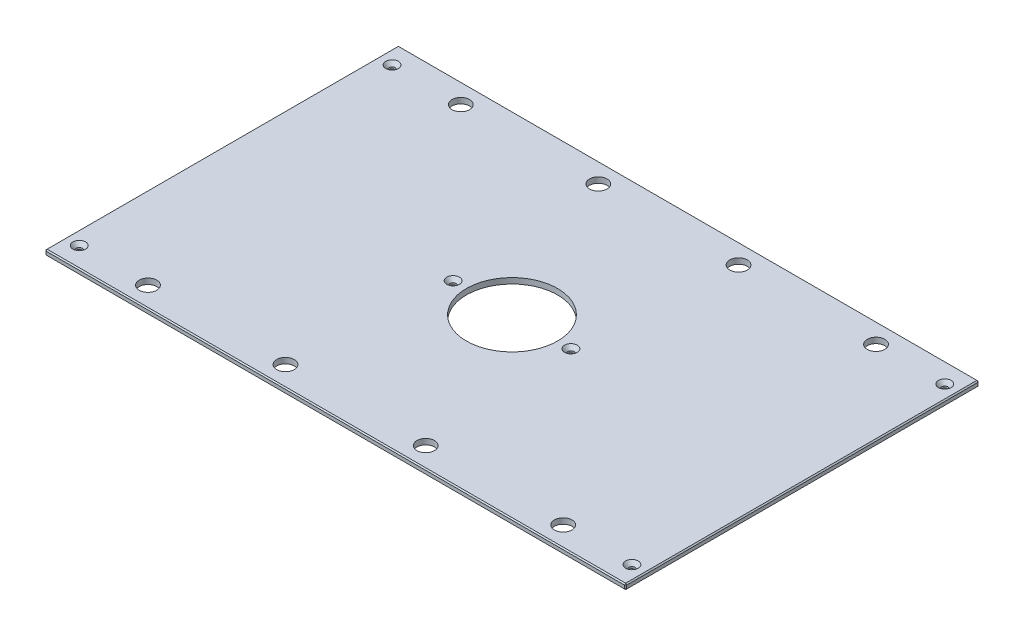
ISO-10303-21;
HEADER;
FILE_DESCRIPTION(('STEP AP214'),'2;1');
FILE_NAME('part.step','',(''),(''),'','','');
FILE_SCHEMA(('AUTOMOTIVE_DESIGN { 1 0 10303 214 1 1 1 1 }'));
ENDSEC;
DATA;
#1=APPLICATION_CONTEXT('core data for automotive mechanical design processes');
#2=APPLICATION_PROTOCOL_DEFINITION('international standard','automotive_design',2000,#1);
#3=PRODUCT_CONTEXT('',#1,'mechanical');
#4=PRODUCT('Part','Part','',(#3));
#5=PRODUCT_RELATED_PRODUCT_CATEGORY('part','',(#4));
#6=PRODUCT_DEFINITION_FORMATION('','',#4);
#7=PRODUCT_DEFINITION_CONTEXT('part definition',#1,'design');
#8=PRODUCT_DEFINITION('design','',#6,#7);
#9=PRODUCT_DEFINITION_SHAPE('','',#8);
#10=(LENGTH_UNIT() NAMED_UNIT(*) SI_UNIT(.MILLI.,.METRE.));
#11=(NAMED_UNIT(*) PLANE_ANGLE_UNIT() SI_UNIT($,.RADIAN.));
#12=(NAMED_UNIT(*) SI_UNIT($,.STERADIAN.) SOLID_ANGLE_UNIT());
#13=UNCERTAINTY_MEASURE_WITH_UNIT(LENGTH_MEASURE(1.E-05),#10,'distance_accuracy_value','');
#14=(GEOMETRIC_REPRESENTATION_CONTEXT(3) GLOBAL_UNCERTAINTY_ASSIGNED_CONTEXT((#13)) GLOBAL_UNIT_ASSIGNED_CONTEXT((#10,
#11,#12)) REPRESENTATION_CONTEXT('',''));
#15=CARTESIAN_POINT('',(0.,0.,0.));
#16=DIRECTION('',(0.,0.,1.));
#17=DIRECTION('',(1.,0.,0.));
#18=AXIS2_PLACEMENT_3D('',#15,#16,#17);
#19=CARTESIAN_POINT('',(-328.6125,6.35,-200.025));
#20=DIRECTION('',(1.,0.,0.));
#21=DIRECTION('',(0.,0.,-1.));
#22=AXIS2_PLACEMENT_3D('',#19,#20,#21);
#23=PLANE('',#22);
#24=DIRECTION('',(0.,0.,-1.));
#25=VECTOR('',#24,1.);
#26=CARTESIAN_POINT('',(-328.6125,5.08000000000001,-200.025));
#27=LINE('',#26,#25);
#28=CARTESIAN_POINT('',(-328.6125,5.08000000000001,198.755));
#29=VERTEX_POINT('',#28);
#30=CARTESIAN_POINT('',(-328.6125,5.08000000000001,-198.755));
#31=VERTEX_POINT('',#30);
#32=EDGE_CURVE('E135',#29,#31,#27,.T.);
#33=ORIENTED_EDGE('',*,*,#32,.T.);
#34=DIRECTION('',(0.,-1.,0.));
#35=VECTOR('',#34,1.);
#36=CARTESIAN_POINT('',(-328.6125,6.35,-198.755));
#37=LINE('',#36,#35);
#38=CARTESIAN_POINT('',(-328.6125,1.26999999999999,-198.755));
#39=VERTEX_POINT('',#38);
#40=EDGE_CURVE('E131',#31,#39,#37,.T.);
#41=ORIENTED_EDGE('',*,*,#40,.T.);
#42=DIRECTION('',(0.,0.,1.));
#43=VECTOR('',#42,1.);
#44=CARTESIAN_POINT('',(-328.6125,1.26999999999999,-200.025));
#45=LINE('',#44,#43);
#46=CARTESIAN_POINT('',(-328.6125,1.26999999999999,198.755));
#47=VERTEX_POINT('',#46);
#48=EDGE_CURVE('E126',#39,#47,#45,.T.);
#49=ORIENTED_EDGE('',*,*,#48,.T.);
#50=DIRECTION('',(0.,1.,0.));
#51=VECTOR('',#50,1.);
#52=CARTESIAN_POINT('',(-328.6125,6.35,198.755));
#53=LINE('',#52,#51);
#54=EDGE_CURVE('E128',#47,#29,#53,.T.);
#55=ORIENTED_EDGE('',*,*,#54,.T.);
#56=EDGE_LOOP('',(#33,#41,#49,#55));
#57=FACE_BOUND('',#56,.T.);
#58=ADVANCED_FACE('F35',(#57),#23,.F.);
#59=CARTESIAN_POINT('',(-328.6125,6.35,200.025));
#60=DIRECTION('',(0.,0.,-1.));
#61=DIRECTION('',(-1.,0.,0.));
#62=AXIS2_PLACEMENT_3D('',#59,#60,#61);
#63=PLANE('',#62);
#64=DIRECTION('',(1.,0.,0.));
#65=VECTOR('',#64,1.);
#66=CARTESIAN_POINT('',(-328.6125,1.26999999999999,200.025));
#67=LINE('',#66,#65);
#68=CARTESIAN_POINT('',(-327.3425,1.26999999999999,200.025));
#69=VERTEX_POINT('',#68);
#70=CARTESIAN_POINT('',(327.3425,1.26999999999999,200.025));
#71=VERTEX_POINT('',#70);
#72=EDGE_CURVE('E58',#69,#71,#67,.T.);
#73=ORIENTED_EDGE('',*,*,#72,.T.);
#74=DIRECTION('',(0.,1.,0.));
#75=VECTOR('',#74,1.);
#76=CARTESIAN_POINT('',(327.3425,6.35,200.025));
#77=LINE('',#76,#75);
#78=CARTESIAN_POINT('',(327.3425,5.08000000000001,200.025));
#79=VERTEX_POINT('',#78);
#80=EDGE_CURVE('E11',#71,#79,#77,.T.);
#81=ORIENTED_EDGE('',*,*,#80,.T.);
#82=DIRECTION('',(-1.,0.,0.));
#83=VECTOR('',#82,1.);
#84=CARTESIAN_POINT('',(-328.6125,5.08000000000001,200.025));
#85=LINE('',#84,#83);
#86=CARTESIAN_POINT('',(-327.3425,5.08000000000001,200.025));
#87=VERTEX_POINT('',#86);
#88=EDGE_CURVE('E44',#79,#87,#85,.T.);
#89=ORIENTED_EDGE('',*,*,#88,.T.);
#90=DIRECTION('',(0.,-1.,0.));
#91=VECTOR('',#90,1.);
#92=CARTESIAN_POINT('',(-327.3425,6.35,200.025));
#93=LINE('',#92,#91);
#94=EDGE_CURVE('E303',#87,#69,#93,.T.);
#95=ORIENTED_EDGE('',*,*,#94,.T.);
#96=EDGE_LOOP('',(#73,#81,#89,#95));
#97=FACE_BOUND('',#96,.T.);
#98=ADVANCED_FACE('F372',(#97),#63,.F.);
#99=CARTESIAN_POINT('',(328.6125,6.35,-200.025));
#100=DIRECTION('',(-1.,0.,0.));
#101=DIRECTION('',(0.,0.,1.));
#102=AXIS2_PLACEMENT_3D('',#99,#100,#101);
#103=PLANE('',#102);
#104=DIRECTION('',(0.,0.,-1.));
#105=VECTOR('',#104,1.);
#106=CARTESIAN_POINT('',(328.6125,1.26999999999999,-200.025));
#107=LINE('',#106,#105);
#108=CARTESIAN_POINT('',(328.6125,1.26999999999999,198.755));
#109=VERTEX_POINT('',#108);
#110=CARTESIAN_POINT('',(328.6125,1.26999999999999,-198.755));
#111=VERTEX_POINT('',#110);
#112=EDGE_CURVE('E298',#109,#111,#107,.T.);
#113=ORIENTED_EDGE('',*,*,#112,.T.);
#114=DIRECTION('',(0.,1.,0.));
#115=VECTOR('',#114,1.);
#116=CARTESIAN_POINT('',(328.6125,6.35,-198.755));
#117=LINE('',#116,#115);
#118=CARTESIAN_POINT('',(328.6125,5.08000000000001,-198.755));
#119=VERTEX_POINT('',#118);
#120=EDGE_CURVE('E300',#111,#119,#117,.T.);
#121=ORIENTED_EDGE('',*,*,#120,.T.);
#122=DIRECTION('',(0.,0.,1.));
#123=VECTOR('',#122,1.);
#124=CARTESIAN_POINT('',(328.6125,5.08000000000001,200.025));
#125=LINE('',#124,#123);
#126=CARTESIAN_POINT('',(328.6125,5.08000000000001,198.755));
#127=VERTEX_POINT('',#126);
#128=EDGE_CURVE('E296',#119,#127,#125,.T.);
#129=ORIENTED_EDGE('',*,*,#128,.T.);
#130=DIRECTION('',(0.,-1.,0.));
#131=VECTOR('',#130,1.);
#132=CARTESIAN_POINT('',(328.6125,6.35,198.755));
#133=LINE('',#132,#131);
#134=EDGE_CURVE('E294',#127,#109,#133,.T.);
#135=ORIENTED_EDGE('',*,*,#134,.T.);
#136=EDGE_LOOP('',(#113,#121,#129,#135));
#137=FACE_BOUND('',#136,.T.);
#138=ADVANCED_FACE('F359',(#137),#103,.F.);
#139=CARTESIAN_POINT('',(-328.6125,6.35,-200.025));
#140=DIRECTION('',(0.,0.,1.));
#141=DIRECTION('',(1.,0.,0.));
#142=AXIS2_PLACEMENT_3D('',#139,#140,#141);
#143=PLANE('',#142);
#144=DIRECTION('',(-1.,0.,0.));
#145=VECTOR('',#144,1.);
#146=CARTESIAN_POINT('',(-328.6125,1.26999999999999,-200.025));
#147=LINE('',#146,#145);
#148=CARTESIAN_POINT('',(327.3425,1.26999999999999,-200.025));
#149=VERTEX_POINT('',#148);
#150=CARTESIAN_POINT('',(-327.3425,1.26999999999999,-200.025));
#151=VERTEX_POINT('',#150);
#152=EDGE_CURVE('E270',#149,#151,#147,.T.);
#153=ORIENTED_EDGE('',*,*,#152,.T.);
#154=DIRECTION('',(0.,1.,0.));
#155=VECTOR('',#154,1.);
#156=CARTESIAN_POINT('',(-327.3425,6.35,-200.025));
#157=LINE('',#156,#155);
#158=CARTESIAN_POINT('',(-327.3425,5.08000000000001,-200.025));
#159=VERTEX_POINT('',#158);
#160=EDGE_CURVE('E274',#151,#159,#157,.T.);
#161=ORIENTED_EDGE('',*,*,#160,.T.);
#162=DIRECTION('',(1.,0.,0.));
#163=VECTOR('',#162,1.);
#164=CARTESIAN_POINT('',(328.6125,5.08000000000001,-200.025));
#165=LINE('',#164,#163);
#166=CARTESIAN_POINT('',(327.3425,5.08000000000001,-200.025));
#167=VERTEX_POINT('',#166);
#168=EDGE_CURVE('E272',#159,#167,#165,.T.);
#169=ORIENTED_EDGE('',*,*,#168,.T.);
#170=DIRECTION('',(0.,-1.,0.));
#171=VECTOR('',#170,1.);
#172=CARTESIAN_POINT('',(327.3425,6.35,-200.025));
#173=LINE('',#172,#171);
#174=EDGE_CURVE('E268',#167,#149,#173,.T.);
#175=ORIENTED_EDGE('',*,*,#174,.T.);
#176=EDGE_LOOP('',(#153,#161,#169,#175));
#177=FACE_BOUND('',#176,.T.);
#178=ADVANCED_FACE('F333',(#177),#143,.F.);
#179=CARTESIAN_POINT('',(0.,6.35,0.));
#180=DIRECTION('',(0.,1.,0.));
#181=DIRECTION('',(0.,0.,1.));
#182=AXIS2_PLACEMENT_3D('',#179,#180,#181);
#183=PLANE('',#182);
#184=CARTESIAN_POINT('',(312.7375,6.35,-177.00498));
#185=DIRECTION('',(0.,1.,0.));
#186=DIRECTION('',(0.,0.,1.));
#187=AXIS2_PLACEMENT_3D('',#184,#185,#186);
#188=CIRCLE('',#187,7.13740000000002);
#189=CARTESIAN_POINT('',(312.7375,6.35,-169.86758));
#190=VERTEX_POINT('',#189);
#191=EDGE_CURVE('E816',#190,#190,#188,.T.);
#192=ORIENTED_EDGE('',*,*,#191,.F.);
#193=EDGE_LOOP('',(#192));
#194=FACE_BOUND('',#193,.T.);
#195=CARTESIAN_POINT('',(312.7375,6.35,177.00498));
#196=DIRECTION('',(0.,1.,0.));
#197=DIRECTION('',(0.,0.,1.));
#198=AXIS2_PLACEMENT_3D('',#195,#196,#197);
#199=CIRCLE('',#198,7.13740000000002);
#200=CARTESIAN_POINT('',(312.7375,6.35,184.14238));
#201=VERTEX_POINT('',#200);
#202=EDGE_CURVE('E820',#201,#201,#199,.T.);
#203=ORIENTED_EDGE('',*,*,#202,.F.);
#204=EDGE_LOOP('',(#203));
#205=FACE_BOUND('',#204,.T.);
#206=CARTESIAN_POINT('',(-312.7375,6.35,177.00498));
#207=DIRECTION('',(0.,1.,0.));
#208=DIRECTION('',(0.,0.,1.));
#209=AXIS2_PLACEMENT_3D('',#206,#207,#208);
#210=CIRCLE('',#209,7.13740000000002);
#211=CARTESIAN_POINT('',(-312.7375,6.35,184.14238));
#212=VERTEX_POINT('',#211);
#213=EDGE_CURVE('E824',#212,#212,#210,.T.);
#214=ORIENTED_EDGE('',*,*,#213,.F.);
#215=EDGE_LOOP('',(#214));
#216=FACE_BOUND('',#215,.T.);
#217=CARTESIAN_POINT('',(-66.675,6.35,0.));
#218=DIRECTION('',(0.,1.,0.));
#219=DIRECTION('',(0.,0.,1.));
#220=AXIS2_PLACEMENT_3D('',#217,#218,#219);
#221=CIRCLE('',#220,7.1374);
#222=CARTESIAN_POINT('',(-66.675,6.35,7.1374));
#223=VERTEX_POINT('',#222);
#224=EDGE_CURVE('E828',#223,#223,#221,.T.);
#225=ORIENTED_EDGE('',*,*,#224,.F.);
#226=EDGE_LOOP('',(#225));
#227=FACE_BOUND('',#226,.T.);
#228=CARTESIAN_POINT('',(66.675,6.35,0.));
#229=DIRECTION('',(0.,1.,0.));
#230=DIRECTION('',(0.,0.,1.));
#231=AXIS2_PLACEMENT_3D('',#228,#229,#230);
#232=CIRCLE('',#231,7.1374);
#233=CARTESIAN_POINT('',(66.675,6.35,7.1374));
#234=VERTEX_POINT('',#233);
#235=EDGE_CURVE('E832',#234,#234,#232,.T.);
#236=ORIENTED_EDGE('',*,*,#235,.F.);
#237=EDGE_LOOP('',(#236));
#238=FACE_BOUND('',#237,.T.);
#239=CARTESIAN_POINT('',(-312.7375,6.35,-177.00498));
#240=DIRECTION('',(0.,1.,0.));
#241=DIRECTION('',(0.,0.,1.));
#242=AXIS2_PLACEMENT_3D('',#239,#240,#241);
#243=CIRCLE('',#242,7.13740000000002);
#244=CARTESIAN_POINT('',(-312.7375,6.35,-169.86758));
#245=VERTEX_POINT('',#244);
#246=EDGE_CURVE('E835',#245,#245,#243,.T.);
#247=ORIENTED_EDGE('',*,*,#246,.F.);
#248=EDGE_LOOP('',(#247));
#249=FACE_BOUND('',#248,.T.);
#250=DIRECTION('',(0.,0.,-1.));
#251=VECTOR('',#250,1.);
#252=CARTESIAN_POINT('',(327.3425,6.35,-200.025));
#253=LINE('',#252,#251);
#254=CARTESIAN_POINT('',(327.3425,6.35,198.755));
#255=VERTEX_POINT('',#254);
#256=CARTESIAN_POINT('',(327.3425,6.35,-198.755));
#257=VERTEX_POINT('',#256);
#258=EDGE_CURVE('E281',#255,#257,#253,.T.);
#259=ORIENTED_EDGE('',*,*,#258,.T.);
#260=DIRECTION('',(-1.,0.,0.));
#261=VECTOR('',#260,1.);
#262=CARTESIAN_POINT('',(-328.6125,6.35,-198.755));
#263=LINE('',#262,#261);
#264=CARTESIAN_POINT('',(-327.3425,6.35,-198.755));
#265=VERTEX_POINT('',#264);
#266=EDGE_CURVE('E283',#257,#265,#263,.T.);
#267=ORIENTED_EDGE('',*,*,#266,.T.);
#268=DIRECTION('',(0.,0.,1.));
#269=VECTOR('',#268,1.);
#270=CARTESIAN_POINT('',(-327.3425,6.35,200.025));
#271=LINE('',#270,#269);
#272=CARTESIAN_POINT('',(-327.3425,6.35,198.755));
#273=VERTEX_POINT('',#272);
#274=EDGE_CURVE('E279',#265,#273,#271,.T.);
#275=ORIENTED_EDGE('',*,*,#274,.T.);
#276=DIRECTION('',(1.,0.,0.));
#277=VECTOR('',#276,1.);
#278=CARTESIAN_POINT('',(328.6125,6.35,198.755));
#279=LINE('',#278,#277);
#280=EDGE_CURVE('E277',#273,#255,#279,.T.);
#281=ORIENTED_EDGE('',*,*,#280,.T.);
#282=EDGE_LOOP('',(#259,#267,#275,#281));
#283=FACE_BOUND('',#282,.T.);
#284=CARTESIAN_POINT('',(234.95,6.35,-177.00498));
#285=DIRECTION('',(0.,1.,0.));
#286=DIRECTION('',(0.,0.,1.));
#287=AXIS2_PLACEMENT_3D('',#284,#285,#286);
#288=CIRCLE('',#287,9.921875);
#289=CARTESIAN_POINT('',(234.95,6.35,-167.083105));
#290=VERTEX_POINT('',#289);
#291=EDGE_CURVE('E204',#290,#290,#288,.T.);
#292=ORIENTED_EDGE('',*,*,#291,.F.);
#293=EDGE_LOOP('',(#292));
#294=FACE_BOUND('',#293,.T.);
#295=CARTESIAN_POINT('',(-234.95,6.35,-177.00498));
#296=DIRECTION('',(0.,1.,0.));
#297=DIRECTION('',(0.,0.,1.));
#298=AXIS2_PLACEMENT_3D('',#295,#296,#297);
#299=CIRCLE('',#298,9.921875);
#300=CARTESIAN_POINT('',(-234.95,6.35,-167.083105));
#301=VERTEX_POINT('',#300);
#302=EDGE_CURVE('E214',#301,#301,#299,.T.);
#303=ORIENTED_EDGE('',*,*,#302,.F.);
#304=EDGE_LOOP('',(#303));
#305=FACE_BOUND('',#304,.T.);
#306=CARTESIAN_POINT('',(234.95,6.35,177.00498));
#307=DIRECTION('',(0.,1.,0.));
#308=DIRECTION('',(0.,0.,1.));
#309=AXIS2_PLACEMENT_3D('',#306,#307,#308);
#310=CIRCLE('',#309,9.921875);
#311=CARTESIAN_POINT('',(234.95,6.35,186.926855));
#312=VERTEX_POINT('',#311);
#313=EDGE_CURVE('E225',#312,#312,#310,.T.);
#314=ORIENTED_EDGE('',*,*,#313,.F.);
#315=EDGE_LOOP('',(#314));
#316=FACE_BOUND('',#315,.T.);
#317=CARTESIAN_POINT('',(-234.95,6.35,177.00498));
#318=DIRECTION('',(0.,1.,0.));
#319=DIRECTION('',(0.,0.,1.));
#320=AXIS2_PLACEMENT_3D('',#317,#318,#319);
#321=CIRCLE('',#320,9.921875);
#322=CARTESIAN_POINT('',(-234.95,6.35,186.926855));
#323=VERTEX_POINT('',#322);
#324=EDGE_CURVE('E231',#323,#323,#321,.T.);
#325=ORIENTED_EDGE('',*,*,#324,.F.);
#326=EDGE_LOOP('',(#325));
#327=FACE_BOUND('',#326,.T.);
#328=CARTESIAN_POINT('',(-79.375,6.35,-177.00498));
#329=DIRECTION('',(0.,1.,0.));
#330=DIRECTION('',(0.,0.,1.));
#331=AXIS2_PLACEMENT_3D('',#328,#329,#330);
#332=CIRCLE('',#331,9.921875);
#333=CARTESIAN_POINT('',(-79.375,6.35,-167.083105));
#334=VERTEX_POINT('',#333);
#335=EDGE_CURVE('E237',#334,#334,#332,.T.);
#336=ORIENTED_EDGE('',*,*,#335,.F.);
#337=EDGE_LOOP('',(#336));
#338=FACE_BOUND('',#337,.T.);
#339=CARTESIAN_POINT('',(79.375,6.35,-177.00498));
#340=DIRECTION('',(0.,1.,0.));
#341=DIRECTION('',(0.,0.,1.));
#342=AXIS2_PLACEMENT_3D('',#339,#340,#341);
#343=CIRCLE('',#342,9.921875);
#344=CARTESIAN_POINT('',(79.375,6.35,-167.083105));
#345=VERTEX_POINT('',#344);
#346=EDGE_CURVE('E243',#345,#345,#343,.T.);
#347=ORIENTED_EDGE('',*,*,#346,.F.);
#348=EDGE_LOOP('',(#347));
#349=FACE_BOUND('',#348,.T.);
#350=CARTESIAN_POINT('',(79.375,6.35,177.00498));
#351=DIRECTION('',(0.,1.,0.));
#352=DIRECTION('',(0.,0.,1.));
#353=AXIS2_PLACEMENT_3D('',#350,#351,#352);
#354=CIRCLE('',#353,9.921875);
#355=CARTESIAN_POINT('',(79.375,6.35,186.926855));
#356=VERTEX_POINT('',#355);
#357=EDGE_CURVE('E249',#356,#356,#354,.T.);
#358=ORIENTED_EDGE('',*,*,#357,.F.);
#359=EDGE_LOOP('',(#358));
#360=FACE_BOUND('',#359,.T.);
#361=CARTESIAN_POINT('',(-79.375,6.35,177.00498));
#362=DIRECTION('',(0.,1.,0.));
#363=DIRECTION('',(0.,0.,1.));
#364=AXIS2_PLACEMENT_3D('',#361,#362,#363);
#365=CIRCLE('',#364,9.921875);
#366=CARTESIAN_POINT('',(-79.375,6.35,186.926855));
#367=VERTEX_POINT('',#366);
#368=EDGE_CURVE('E255',#367,#367,#365,.T.);
#369=ORIENTED_EDGE('',*,*,#368,.F.);
#370=EDGE_LOOP('',(#369));
#371=FACE_BOUND('',#370,.T.);
#372=CARTESIAN_POINT('',(0.,6.35,0.));
#373=DIRECTION('',(0.,1.,0.));
#374=DIRECTION('',(0.,0.,1.));
#375=AXIS2_PLACEMENT_3D('',#372,#373,#374);
#376=CIRCLE('',#375,51.562);
#377=CARTESIAN_POINT('',(0.,6.35,51.562));
#378=VERTEX_POINT('',#377);
#379=EDGE_CURVE('E261',#378,#378,#376,.T.);
#380=ORIENTED_EDGE('',*,*,#379,.F.);
#381=EDGE_LOOP('',(#380));
#382=FACE_BOUND('',#381,.T.);
#383=ADVANCED_FACE('F381',(#194,#205,#216,#227,#238,#249,#283,#294,#305,#316,#327,#338,#349,
#360,#371,#382),#183,.T.);
#384=CARTESIAN_POINT('',(0.,0.,0.));
#385=DIRECTION('',(0.,1.,0.));
#386=DIRECTION('',(0.,0.,1.));
#387=AXIS2_PLACEMENT_3D('',#384,#385,#386);
#388=PLANE('',#387);
#389=CARTESIAN_POINT('',(312.7375,0.,-177.00498));
#390=DIRECTION('',(0.,1.,0.));
#391=DIRECTION('',(0.,0.,1.));
#392=AXIS2_PLACEMENT_3D('',#389,#390,#391);
#393=CIRCLE('',#392,3.3782);
#394=CARTESIAN_POINT('',(312.7375,0.,-173.62678));
#395=VERTEX_POINT('',#394);
#396=EDGE_CURVE('E869',#395,#395,#393,.T.);
#397=ORIENTED_EDGE('',*,*,#396,.T.);
#398=EDGE_LOOP('',(#397));
#399=FACE_BOUND('',#398,.T.);
#400=CARTESIAN_POINT('',(312.7375,0.,177.00498));
#401=DIRECTION('',(0.,1.,0.));
#402=DIRECTION('',(0.,0.,1.));
#403=AXIS2_PLACEMENT_3D('',#400,#401,#402);
#404=CIRCLE('',#403,3.3782);
#405=CARTESIAN_POINT('',(312.7375,0.,180.38318));
#406=VERTEX_POINT('',#405);
#407=EDGE_CURVE('E862',#406,#406,#404,.T.);
#408=ORIENTED_EDGE('',*,*,#407,.T.);
#409=EDGE_LOOP('',(#408));
#410=FACE_BOUND('',#409,.T.);
#411=CARTESIAN_POINT('',(-312.7375,0.,177.00498));
#412=DIRECTION('',(0.,1.,0.));
#413=DIRECTION('',(0.,0.,1.));
#414=AXIS2_PLACEMENT_3D('',#411,#412,#413);
#415=CIRCLE('',#414,3.3782);
#416=CARTESIAN_POINT('',(-312.7375,0.,180.38318));
#417=VERTEX_POINT('',#416);
#418=EDGE_CURVE('E855',#417,#417,#415,.T.);
#419=ORIENTED_EDGE('',*,*,#418,.T.);
#420=EDGE_LOOP('',(#419));
#421=FACE_BOUND('',#420,.T.);
#422=CARTESIAN_POINT('',(-66.675,0.,0.));
#423=DIRECTION('',(0.,1.,0.));
#424=DIRECTION('',(0.,0.,1.));
#425=AXIS2_PLACEMENT_3D('',#422,#423,#424);
#426=CIRCLE('',#425,3.3782);
#427=CARTESIAN_POINT('',(-66.675,0.,3.3782));
#428=VERTEX_POINT('',#427);
#429=EDGE_CURVE('E848',#428,#428,#426,.T.);
#430=ORIENTED_EDGE('',*,*,#429,.T.);
#431=EDGE_LOOP('',(#430));
#432=FACE_BOUND('',#431,.T.);
#433=CARTESIAN_POINT('',(66.675,0.,0.));
#434=DIRECTION('',(0.,1.,0.));
#435=DIRECTION('',(0.,0.,1.));
#436=AXIS2_PLACEMENT_3D('',#433,#434,#435);
#437=CIRCLE('',#436,3.3782);
#438=CARTESIAN_POINT('',(66.675,0.,3.3782));
#439=VERTEX_POINT('',#438);
#440=EDGE_CURVE('E838',#439,#439,#437,.T.);
#441=ORIENTED_EDGE('',*,*,#440,.T.);
#442=EDGE_LOOP('',(#441));
#443=FACE_BOUND('',#442,.T.);
#444=CARTESIAN_POINT('',(-312.7375,0.,-177.00498));
#445=DIRECTION('',(0.,1.,0.));
#446=DIRECTION('',(0.,0.,1.));
#447=AXIS2_PLACEMENT_3D('',#444,#445,#446);
#448=CIRCLE('',#447,3.3782);
#449=CARTESIAN_POINT('',(-312.7375,0.,-173.62678));
#450=VERTEX_POINT('',#449);
#451=EDGE_CURVE('E217',#450,#450,#448,.T.);
#452=ORIENTED_EDGE('',*,*,#451,.T.);
#453=EDGE_LOOP('',(#452));
#454=FACE_BOUND('',#453,.T.);
#455=DIRECTION('',(0.,0.,-1.));
#456=VECTOR('',#455,1.);
#457=CARTESIAN_POINT('',(-327.3425,0.,0.));
#458=LINE('',#457,#456);
#459=CARTESIAN_POINT('',(-327.3425,0.,198.755));
#460=VERTEX_POINT('',#459);
#461=CARTESIAN_POINT('',(-327.3425,0.,-198.755));
#462=VERTEX_POINT('',#461);
#463=EDGE_CURVE('E158',#460,#462,#458,.T.);
#464=ORIENTED_EDGE('',*,*,#463,.T.);
#465=DIRECTION('',(1.,0.,0.));
#466=VECTOR('',#465,1.);
#467=CARTESIAN_POINT('',(0.,0.,-198.755));
#468=LINE('',#467,#466);
#469=CARTESIAN_POINT('',(327.3425,0.,-198.755));
#470=VERTEX_POINT('',#469);
#471=EDGE_CURVE('E291',#462,#470,#468,.T.);
#472=ORIENTED_EDGE('',*,*,#471,.T.);
#473=DIRECTION('',(0.,0.,1.));
#474=VECTOR('',#473,1.);
#475=CARTESIAN_POINT('',(327.3425,0.,0.));
#476=LINE('',#475,#474);
#477=CARTESIAN_POINT('',(327.3425,0.,198.755));
#478=VERTEX_POINT('',#477);
#479=EDGE_CURVE('E289',#470,#478,#476,.T.);
#480=ORIENTED_EDGE('',*,*,#479,.T.);
#481=DIRECTION('',(-1.,0.,0.));
#482=VECTOR('',#481,1.);
#483=CARTESIAN_POINT('',(0.,0.,198.755));
#484=LINE('',#483,#482);
#485=EDGE_CURVE('E286',#478,#460,#484,.T.);
#486=ORIENTED_EDGE('',*,*,#485,.T.);
#487=EDGE_LOOP('',(#464,#472,#480,#486));
#488=FACE_BOUND('',#487,.T.);
#489=CARTESIAN_POINT('',(234.95,0.,-177.00498));
#490=DIRECTION('',(0.,1.,0.));
#491=DIRECTION('',(0.,0.,1.));
#492=AXIS2_PLACEMENT_3D('',#489,#490,#491);
#493=CIRCLE('',#492,9.921875);
#494=CARTESIAN_POINT('',(234.95,0.,-167.083105));
#495=VERTEX_POINT('',#494);
#496=EDGE_CURVE('E209',#495,#495,#493,.T.);
#497=ORIENTED_EDGE('',*,*,#496,.T.);
#498=EDGE_LOOP('',(#497));
#499=FACE_BOUND('',#498,.T.);
#500=CARTESIAN_POINT('',(-234.95,0.,-177.00498));
#501=DIRECTION('',(0.,1.,0.));
#502=DIRECTION('',(0.,0.,1.));
#503=AXIS2_PLACEMENT_3D('',#500,#501,#502);
#504=CIRCLE('',#503,9.921875);
#505=CARTESIAN_POINT('',(-234.95,0.,-167.083105));
#506=VERTEX_POINT('',#505);
#507=EDGE_CURVE('E222',#506,#506,#504,.T.);
#508=ORIENTED_EDGE('',*,*,#507,.T.);
#509=EDGE_LOOP('',(#508));
#510=FACE_BOUND('',#509,.T.);
#511=CARTESIAN_POINT('',(234.95,0.,177.00498));
#512=DIRECTION('',(0.,1.,0.));
#513=DIRECTION('',(0.,0.,1.));
#514=AXIS2_PLACEMENT_3D('',#511,#512,#513);
#515=CIRCLE('',#514,9.921875);
#516=CARTESIAN_POINT('',(234.95,0.,186.926855));
#517=VERTEX_POINT('',#516);
#518=EDGE_CURVE('E228',#517,#517,#515,.T.);
#519=ORIENTED_EDGE('',*,*,#518,.T.);
#520=EDGE_LOOP('',(#519));
#521=FACE_BOUND('',#520,.T.);
#522=CARTESIAN_POINT('',(-234.95,0.,177.00498));
#523=DIRECTION('',(0.,1.,0.));
#524=DIRECTION('',(0.,0.,1.));
#525=AXIS2_PLACEMENT_3D('',#522,#523,#524);
#526=CIRCLE('',#525,9.921875);
#527=CARTESIAN_POINT('',(-234.95,0.,186.926855));
#528=VERTEX_POINT('',#527);
#529=EDGE_CURVE('E234',#528,#528,#526,.T.);
#530=ORIENTED_EDGE('',*,*,#529,.T.);
#531=EDGE_LOOP('',(#530));
#532=FACE_BOUND('',#531,.T.);
#533=CARTESIAN_POINT('',(-79.375,0.,-177.00498));
#534=DIRECTION('',(0.,1.,0.));
#535=DIRECTION('',(0.,0.,1.));
#536=AXIS2_PLACEMENT_3D('',#533,#534,#535);
#537=CIRCLE('',#536,9.921875);
#538=CARTESIAN_POINT('',(-79.375,0.,-167.083105));
#539=VERTEX_POINT('',#538);
#540=EDGE_CURVE('E240',#539,#539,#537,.T.);
#541=ORIENTED_EDGE('',*,*,#540,.T.);
#542=EDGE_LOOP('',(#541));
#543=FACE_BOUND('',#542,.T.);
#544=CARTESIAN_POINT('',(79.375,0.,-177.00498));
#545=DIRECTION('',(0.,1.,0.));
#546=DIRECTION('',(0.,0.,1.));
#547=AXIS2_PLACEMENT_3D('',#544,#545,#546);
#548=CIRCLE('',#547,9.921875);
#549=CARTESIAN_POINT('',(79.375,0.,-167.083105));
#550=VERTEX_POINT('',#549);
#551=EDGE_CURVE('E246',#550,#550,#548,.T.);
#552=ORIENTED_EDGE('',*,*,#551,.T.);
#553=EDGE_LOOP('',(#552));
#554=FACE_BOUND('',#553,.T.);
#555=CARTESIAN_POINT('',(79.375,0.,177.00498));
#556=DIRECTION('',(0.,1.,0.));
#557=DIRECTION('',(0.,0.,1.));
#558=AXIS2_PLACEMENT_3D('',#555,#556,#557);
#559=CIRCLE('',#558,9.921875);
#560=CARTESIAN_POINT('',(79.375,0.,186.926855));
#561=VERTEX_POINT('',#560);
#562=EDGE_CURVE('E252',#561,#561,#559,.T.);
#563=ORIENTED_EDGE('',*,*,#562,.T.);
#564=EDGE_LOOP('',(#563));
#565=FACE_BOUND('',#564,.T.);
#566=CARTESIAN_POINT('',(-79.375,0.,177.00498));
#567=DIRECTION('',(0.,1.,0.));
#568=DIRECTION('',(0.,0.,1.));
#569=AXIS2_PLACEMENT_3D('',#566,#567,#568);
#570=CIRCLE('',#569,9.921875);
#571=CARTESIAN_POINT('',(-79.375,0.,186.926855));
#572=VERTEX_POINT('',#571);
#573=EDGE_CURVE('E258',#572,#572,#570,.T.);
#574=ORIENTED_EDGE('',*,*,#573,.T.);
#575=EDGE_LOOP('',(#574));
#576=FACE_BOUND('',#575,.T.);
#577=CARTESIAN_POINT('',(0.,0.,0.));
#578=DIRECTION('',(0.,1.,0.));
#579=DIRECTION('',(0.,0.,1.));
#580=AXIS2_PLACEMENT_3D('',#577,#578,#579);
#581=CIRCLE('',#580,51.562);
#582=CARTESIAN_POINT('',(0.,0.,51.562));
#583=VERTEX_POINT('',#582);
#584=EDGE_CURVE('E147',#583,#583,#581,.T.);
#585=ORIENTED_EDGE('',*,*,#584,.T.);
#586=EDGE_LOOP('',(#585));
#587=FACE_BOUND('',#586,.T.);
#588=ADVANCED_FACE('F346',(#399,#410,#421,#432,#443,#454,#488,#499,#510,#521,#532,#543,#554,
#565,#576,#587),#388,.F.);
#589=CARTESIAN_POINT('',(0.,0.,0.));
#590=DIRECTION('',(0.,1.,0.));
#591=DIRECTION('',(0.,0.,1.));
#592=AXIS2_PLACEMENT_3D('',#589,#590,#591);
#593=CYLINDRICAL_SURFACE('',#592,51.562);
#594=ORIENTED_EDGE('',*,*,#584,.F.);
#595=EDGE_LOOP('',(#594));
#596=FACE_BOUND('',#595,.T.);
#597=ORIENTED_EDGE('',*,*,#379,.T.);
#598=EDGE_LOOP('',(#597));
#599=FACE_BOUND('',#598,.T.);
#600=ADVANCED_FACE('F751',(#596,#599),#593,.F.);
#601=CARTESIAN_POINT('',(-79.375,6.35,177.00498));
#602=DIRECTION('',(0.,1.,0.));
#603=DIRECTION('',(0.,0.,1.));
#604=AXIS2_PLACEMENT_3D('',#601,#602,#603);
#605=CYLINDRICAL_SURFACE('',#604,9.921875);
#606=ORIENTED_EDGE('',*,*,#573,.F.);
#607=EDGE_LOOP('',(#606));
#608=FACE_BOUND('',#607,.T.);
#609=ORIENTED_EDGE('',*,*,#368,.T.);
#610=EDGE_LOOP('',(#609));
#611=FACE_BOUND('',#610,.T.);
#612=ADVANCED_FACE('F742',(#608,#611),#605,.F.);
#613=CARTESIAN_POINT('',(79.375,6.35,177.00498));
#614=DIRECTION('',(0.,1.,0.));
#615=DIRECTION('',(0.,0.,1.));
#616=AXIS2_PLACEMENT_3D('',#613,#614,#615);
#617=CYLINDRICAL_SURFACE('',#616,9.921875);
#618=ORIENTED_EDGE('',*,*,#562,.F.);
#619=EDGE_LOOP('',(#618));
#620=FACE_BOUND('',#619,.T.);
#621=ORIENTED_EDGE('',*,*,#357,.T.);
#622=EDGE_LOOP('',(#621));
#623=FACE_BOUND('',#622,.T.);
#624=ADVANCED_FACE('F733',(#620,#623),#617,.F.);
#625=CARTESIAN_POINT('',(79.375,6.35,-177.00498));
#626=DIRECTION('',(0.,1.,0.));
#627=DIRECTION('',(0.,0.,1.));
#628=AXIS2_PLACEMENT_3D('',#625,#626,#627);
#629=CYLINDRICAL_SURFACE('',#628,9.921875);
#630=ORIENTED_EDGE('',*,*,#551,.F.);
#631=EDGE_LOOP('',(#630));
#632=FACE_BOUND('',#631,.T.);
#633=ORIENTED_EDGE('',*,*,#346,.T.);
#634=EDGE_LOOP('',(#633));
#635=FACE_BOUND('',#634,.T.);
#636=ADVANCED_FACE('F724',(#632,#635),#629,.F.);
#637=CARTESIAN_POINT('',(-79.375,6.35,-177.00498));
#638=DIRECTION('',(0.,1.,0.));
#639=DIRECTION('',(0.,0.,1.));
#640=AXIS2_PLACEMENT_3D('',#637,#638,#639);
#641=CYLINDRICAL_SURFACE('',#640,9.921875);
#642=ORIENTED_EDGE('',*,*,#540,.F.);
#643=EDGE_LOOP('',(#642));
#644=FACE_BOUND('',#643,.T.);
#645=ORIENTED_EDGE('',*,*,#335,.T.);
#646=EDGE_LOOP('',(#645));
#647=FACE_BOUND('',#646,.T.);
#648=ADVANCED_FACE('F715',(#644,#647),#641,.F.);
#649=CARTESIAN_POINT('',(-234.95,6.35,177.00498));
#650=DIRECTION('',(0.,1.,0.));
#651=DIRECTION('',(0.,0.,1.));
#652=AXIS2_PLACEMENT_3D('',#649,#650,#651);
#653=CYLINDRICAL_SURFACE('',#652,9.921875);
#654=ORIENTED_EDGE('',*,*,#529,.F.);
#655=EDGE_LOOP('',(#654));
#656=FACE_BOUND('',#655,.T.);
#657=ORIENTED_EDGE('',*,*,#324,.T.);
#658=EDGE_LOOP('',(#657));
#659=FACE_BOUND('',#658,.T.);
#660=ADVANCED_FACE('F706',(#656,#659),#653,.F.);
#661=CARTESIAN_POINT('',(234.95,6.35,177.00498));
#662=DIRECTION('',(0.,1.,0.));
#663=DIRECTION('',(0.,0.,1.));
#664=AXIS2_PLACEMENT_3D('',#661,#662,#663);
#665=CYLINDRICAL_SURFACE('',#664,9.921875);
#666=ORIENTED_EDGE('',*,*,#518,.F.);
#667=EDGE_LOOP('',(#666));
#668=FACE_BOUND('',#667,.T.);
#669=ORIENTED_EDGE('',*,*,#313,.T.);
#670=EDGE_LOOP('',(#669));
#671=FACE_BOUND('',#670,.T.);
#672=ADVANCED_FACE('F697',(#668,#671),#665,.F.);
#673=CARTESIAN_POINT('',(-234.95,6.35,-177.00498));
#674=DIRECTION('',(0.,1.,0.));
#675=DIRECTION('',(0.,0.,1.));
#676=AXIS2_PLACEMENT_3D('',#673,#674,#675);
#677=CYLINDRICAL_SURFACE('',#676,9.921875);
#678=ORIENTED_EDGE('',*,*,#507,.F.);
#679=EDGE_LOOP('',(#678));
#680=FACE_BOUND('',#679,.T.);
#681=ORIENTED_EDGE('',*,*,#302,.T.);
#682=EDGE_LOOP('',(#681));
#683=FACE_BOUND('',#682,.T.);
#684=ADVANCED_FACE('F687',(#680,#683),#677,.F.);
#685=CARTESIAN_POINT('',(234.95,6.35,-177.00498));
#686=DIRECTION('',(0.,1.,0.));
#687=DIRECTION('',(0.,0.,1.));
#688=AXIS2_PLACEMENT_3D('',#685,#686,#687);
#689=CYLINDRICAL_SURFACE('',#688,9.921875);
#690=ORIENTED_EDGE('',*,*,#496,.F.);
#691=EDGE_LOOP('',(#690));
#692=FACE_BOUND('',#691,.T.);
#693=ORIENTED_EDGE('',*,*,#291,.T.);
#694=EDGE_LOOP('',(#693));
#695=FACE_BOUND('',#694,.T.);
#696=ADVANCED_FACE('F390',(#692,#695),#689,.F.);
#697=CARTESIAN_POINT('',(328.6125,6.35,198.755));
#698=DIRECTION('',(-0.707106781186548,0.,-0.707106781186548));
#699=DIRECTION('',(0.,-1.,0.));
#700=AXIS2_PLACEMENT_3D('',#697,#698,#699);
#701=PLANE('',#700);
#702=DIRECTION('',(-0.707106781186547,0.,0.707106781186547));
#703=VECTOR('',#702,1.);
#704=CARTESIAN_POINT('',(328.6125,5.08000000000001,198.755));
#705=LINE('',#704,#703);
#706=EDGE_CURVE('E39',#79,#127,#705,.F.);
#707=ORIENTED_EDGE('',*,*,#706,.F.);
#708=ORIENTED_EDGE('',*,*,#80,.F.);
#709=DIRECTION('',(0.707106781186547,0.,-0.707106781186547));
#710=VECTOR('',#709,1.);
#711=CARTESIAN_POINT('',(327.9775,1.26999999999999,199.39));
#712=LINE('',#711,#710);
#713=EDGE_CURVE('E197',#109,#71,#712,.F.);
#714=ORIENTED_EDGE('',*,*,#713,.F.);
#715=ORIENTED_EDGE('',*,*,#134,.F.);
#716=EDGE_LOOP('',(#707,#708,#714,#715));
#717=FACE_BOUND('',#716,.T.);
#718=ADVANCED_FACE('F37',(#717),#701,.F.);
#719=CARTESIAN_POINT('',(328.6125,5.08000000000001,198.755));
#720=DIRECTION('',(0.577350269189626,0.577350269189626,0.577350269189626));
#721=DIRECTION('',(0.707106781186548,0.,-0.707106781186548));
#722=AXIS2_PLACEMENT_3D('',#719,#720,#721);
#723=PLANE('',#722);
#724=DIRECTION('',(0.,-0.707106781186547,0.707106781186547));
#725=VECTOR('',#724,1.);
#726=CARTESIAN_POINT('',(327.3425,5.715,199.39));
#727=LINE('',#726,#725);
#728=EDGE_CURVE('E193',#79,#255,#727,.F.);
#729=ORIENTED_EDGE('',*,*,#728,.F.);
#730=ORIENTED_EDGE('',*,*,#706,.T.);
#731=DIRECTION('',(-0.707106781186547,0.707106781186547,0.));
#732=VECTOR('',#731,1.);
#733=CARTESIAN_POINT('',(328.6125,5.08000000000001,198.755));
#734=LINE('',#733,#732);
#735=EDGE_CURVE('E195',#255,#127,#734,.F.);
#736=ORIENTED_EDGE('',*,*,#735,.F.);
#737=EDGE_LOOP('',(#729,#730,#736));
#738=FACE_BOUND('',#737,.T.);
#739=ADVANCED_FACE('F383',(#738),#723,.T.);
#740=CARTESIAN_POINT('',(327.3425,0.,198.755));
#741=DIRECTION('',(0.577350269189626,-0.577350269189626,0.577350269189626));
#742=DIRECTION('',(0.707106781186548,0.,-0.707106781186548));
#743=AXIS2_PLACEMENT_3D('',#740,#741,#742);
#744=PLANE('',#743);
#745=DIRECTION('',(-0.707106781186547,-0.707106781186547,0.));
#746=VECTOR('',#745,1.);
#747=CARTESIAN_POINT('',(327.3425,0.,198.755));
#748=LINE('',#747,#746);
#749=EDGE_CURVE('E187',#109,#478,#748,.T.);
#750=ORIENTED_EDGE('',*,*,#749,.F.);
#751=ORIENTED_EDGE('',*,*,#713,.T.);
#752=DIRECTION('',(0.,0.707106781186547,0.707106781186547));
#753=VECTOR('',#752,1.);
#754=CARTESIAN_POINT('',(327.3425,0.,198.755));
#755=LINE('',#754,#753);
#756=EDGE_CURVE('E190',#478,#71,#755,.T.);
#757=ORIENTED_EDGE('',*,*,#756,.F.);
#758=EDGE_LOOP('',(#750,#751,#757));
#759=FACE_BOUND('',#758,.T.);
#760=ADVANCED_FACE('F352',(#759),#744,.T.);
#761=CARTESIAN_POINT('',(327.3425,6.35,0.));
#762=DIRECTION('',(0.707106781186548,0.707106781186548,0.));
#763=DIRECTION('',(0.,0.,1.));
#764=AXIS2_PLACEMENT_3D('',#761,#762,#763);
#765=PLANE('',#764);
#766=ORIENTED_EDGE('',*,*,#735,.T.);
#767=ORIENTED_EDGE('',*,*,#128,.F.);
#768=DIRECTION('',(0.707106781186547,-0.707106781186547,0.));
#769=VECTOR('',#768,1.);
#770=CARTESIAN_POINT('',(327.9775,5.715,-198.755));
#771=LINE('',#770,#769);
#772=EDGE_CURVE('E182',#257,#119,#771,.T.);
#773=ORIENTED_EDGE('',*,*,#772,.F.);
#774=ORIENTED_EDGE('',*,*,#258,.F.);
#775=EDGE_LOOP('',(#766,#767,#773,#774));
#776=FACE_BOUND('',#775,.T.);
#777=ADVANCED_FACE('F369',(#776),#765,.T.);
#778=CARTESIAN_POINT('',(0.,6.35,198.755));
#779=DIRECTION('',(0.,0.707106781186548,0.707106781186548));
#780=DIRECTION('',(-1.,0.,0.));
#781=AXIS2_PLACEMENT_3D('',#778,#779,#780);
#782=PLANE('',#781);
#783=ORIENTED_EDGE('',*,*,#728,.T.);
#784=ORIENTED_EDGE('',*,*,#280,.F.);
#785=DIRECTION('',(0.,0.707106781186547,-0.707106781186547));
#786=VECTOR('',#785,1.);
#787=CARTESIAN_POINT('',(-327.3425,6.35,198.755));
#788=LINE('',#787,#786);
#789=EDGE_CURVE('E179',#87,#273,#788,.T.);
#790=ORIENTED_EDGE('',*,*,#789,.F.);
#791=ORIENTED_EDGE('',*,*,#88,.F.);
#792=EDGE_LOOP('',(#783,#784,#790,#791));
#793=FACE_BOUND('',#792,.T.);
#794=ADVANCED_FACE('F374',(#793),#782,.T.);
#795=CARTESIAN_POINT('',(-327.3425,6.35,200.025));
#796=DIRECTION('',(0.707106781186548,0.,-0.707106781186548));
#797=DIRECTION('',(0.,-1.,0.));
#798=AXIS2_PLACEMENT_3D('',#795,#796,#797);
#799=PLANE('',#798);
#800=DIRECTION('',(0.707106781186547,0.,0.707106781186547));
#801=VECTOR('',#800,1.);
#802=CARTESIAN_POINT('',(-328.6125,1.26999999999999,198.755));
#803=LINE('',#802,#801);
#804=EDGE_CURVE('E142',#69,#47,#803,.F.);
#805=ORIENTED_EDGE('',*,*,#804,.F.);
#806=ORIENTED_EDGE('',*,*,#94,.F.);
#807=DIRECTION('',(-0.707106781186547,0.,-0.707106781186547));
#808=VECTOR('',#807,1.);
#809=CARTESIAN_POINT('',(-327.9775,5.08000000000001,199.39));
#810=LINE('',#809,#808);
#811=EDGE_CURVE('E145',#29,#87,#810,.F.);
#812=ORIENTED_EDGE('',*,*,#811,.F.);
#813=ORIENTED_EDGE('',*,*,#54,.F.);
#814=EDGE_LOOP('',(#805,#806,#812,#813));
#815=FACE_BOUND('',#814,.T.);
#816=ADVANCED_FACE('F140',(#815),#799,.F.);
#817=CARTESIAN_POINT('',(-328.6125,1.26999999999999,200.025));
#818=DIRECTION('',(0.,0.707106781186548,-0.707106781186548));
#819=DIRECTION('',(1.,0.,0.));
#820=AXIS2_PLACEMENT_3D('',#817,#818,#819);
#821=PLANE('',#820);
#822=ORIENTED_EDGE('',*,*,#756,.T.);
#823=ORIENTED_EDGE('',*,*,#72,.F.);
#824=DIRECTION('',(0.,-0.707106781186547,-0.707106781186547));
#825=VECTOR('',#824,1.);
#826=CARTESIAN_POINT('',(-327.3425,0.634999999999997,199.39));
#827=LINE('',#826,#825);
#828=EDGE_CURVE('E155',#460,#69,#827,.F.);
#829=ORIENTED_EDGE('',*,*,#828,.F.);
#830=ORIENTED_EDGE('',*,*,#485,.F.);
#831=EDGE_LOOP('',(#822,#823,#829,#830));
#832=FACE_BOUND('',#831,.T.);
#833=ADVANCED_FACE('F351',(#832),#821,.F.);
#834=CARTESIAN_POINT('',(328.6125,1.26999999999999,-200.025));
#835=DIRECTION('',(-0.707106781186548,0.707106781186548,0.));
#836=DIRECTION('',(0.,0.,-1.));
#837=AXIS2_PLACEMENT_3D('',#834,#835,#836);
#838=PLANE('',#837);
#839=ORIENTED_EDGE('',*,*,#749,.T.);
#840=ORIENTED_EDGE('',*,*,#479,.F.);
#841=DIRECTION('',(0.707106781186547,0.707106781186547,0.));
#842=VECTOR('',#841,1.);
#843=CARTESIAN_POINT('',(327.3425,0.,-198.755));
#844=LINE('',#843,#842);
#845=EDGE_CURVE('E174',#111,#470,#844,.F.);
#846=ORIENTED_EDGE('',*,*,#845,.F.);
#847=ORIENTED_EDGE('',*,*,#112,.F.);
#848=EDGE_LOOP('',(#839,#840,#846,#847));
#849=FACE_BOUND('',#848,.T.);
#850=ADVANCED_FACE('F356',(#849),#838,.F.);
#851=CARTESIAN_POINT('',(327.3425,6.35,-200.025));
#852=DIRECTION('',(-0.707106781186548,0.,0.707106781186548));
#853=DIRECTION('',(0.,-1.,0.));
#854=AXIS2_PLACEMENT_3D('',#851,#852,#853);
#855=PLANE('',#854);
#856=DIRECTION('',(0.707106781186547,0.,0.707106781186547));
#857=VECTOR('',#856,1.);
#858=CARTESIAN_POINT('',(327.3425,5.08000000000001,-200.025));
#859=LINE('',#858,#857);
#860=EDGE_CURVE('E184',#119,#167,#859,.F.);
#861=ORIENTED_EDGE('',*,*,#860,.F.);
#862=ORIENTED_EDGE('',*,*,#120,.F.);
#863=DIRECTION('',(-0.707106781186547,0.,-0.707106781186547));
#864=VECTOR('',#863,1.);
#865=CARTESIAN_POINT('',(327.9775,1.26999999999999,-199.39));
#866=LINE('',#865,#864);
#867=EDGE_CURVE('E171',#149,#111,#866,.F.);
#868=ORIENTED_EDGE('',*,*,#867,.F.);
#869=ORIENTED_EDGE('',*,*,#174,.F.);
#870=EDGE_LOOP('',(#861,#862,#868,#869));
#871=FACE_BOUND('',#870,.T.);
#872=ADVANCED_FACE('F364',(#871),#855,.F.);
#873=CARTESIAN_POINT('',(327.3425,5.08000000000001,-200.025));
#874=DIRECTION('',(0.577350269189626,0.577350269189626,-0.577350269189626));
#875=DIRECTION('',(-0.707106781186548,0.,-0.707106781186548));
#876=AXIS2_PLACEMENT_3D('',#873,#874,#875);
#877=PLANE('',#876);
#878=ORIENTED_EDGE('',*,*,#772,.T.);
#879=ORIENTED_EDGE('',*,*,#860,.T.);
#880=DIRECTION('',(0.,0.707106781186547,0.707106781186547));
#881=VECTOR('',#880,1.);
#882=CARTESIAN_POINT('',(327.3425,5.08000000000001,-200.025));
#883=LINE('',#882,#881);
#884=EDGE_CURVE('E163',#257,#167,#883,.F.);
#885=ORIENTED_EDGE('',*,*,#884,.F.);
#886=EDGE_LOOP('',(#878,#879,#885));
#887=FACE_BOUND('',#886,.T.);
#888=ADVANCED_FACE('F422',(#887),#877,.T.);
#889=CARTESIAN_POINT('',(-327.3425,6.35,198.755));
#890=DIRECTION('',(-0.577350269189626,0.577350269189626,0.577350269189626));
#891=DIRECTION('',(0.707106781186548,0.,0.707106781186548));
#892=AXIS2_PLACEMENT_3D('',#889,#890,#891);
#893=PLANE('',#892);
#894=ORIENTED_EDGE('',*,*,#811,.T.);
#895=ORIENTED_EDGE('',*,*,#789,.T.);
#896=DIRECTION('',(-0.707106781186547,-0.707106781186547,0.));
#897=VECTOR('',#896,1.);
#898=CARTESIAN_POINT('',(-327.3425,6.35,198.755));
#899=LINE('',#898,#897);
#900=EDGE_CURVE('E159',#29,#273,#899,.F.);
#901=ORIENTED_EDGE('',*,*,#900,.F.);
#902=EDGE_LOOP('',(#894,#895,#901));
#903=FACE_BOUND('',#902,.T.);
#904=ADVANCED_FACE('F376',(#903),#893,.T.);
#905=CARTESIAN_POINT('',(-328.6125,1.26999999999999,198.755));
#906=DIRECTION('',(-0.577350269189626,-0.577350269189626,0.577350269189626));
#907=DIRECTION('',(0.707106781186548,0.,0.707106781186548));
#908=AXIS2_PLACEMENT_3D('',#905,#906,#907);
#909=PLANE('',#908);
#910=ORIENTED_EDGE('',*,*,#828,.T.);
#911=ORIENTED_EDGE('',*,*,#804,.T.);
#912=DIRECTION('',(-0.707106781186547,0.707106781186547,0.));
#913=VECTOR('',#912,1.);
#914=CARTESIAN_POINT('',(-328.6125,1.26999999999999,198.755));
#915=LINE('',#914,#913);
#916=EDGE_CURVE('E152',#460,#47,#915,.T.);
#917=ORIENTED_EDGE('',*,*,#916,.F.);
#918=EDGE_LOOP('',(#910,#911,#917));
#919=FACE_BOUND('',#918,.T.);
#920=ADVANCED_FACE('F151',(#919),#909,.T.);
#921=CARTESIAN_POINT('',(327.3425,0.,-198.755));
#922=DIRECTION('',(0.577350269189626,-0.577350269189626,-0.577350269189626));
#923=DIRECTION('',(-0.707106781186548,0.,-0.707106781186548));
#924=AXIS2_PLACEMENT_3D('',#921,#922,#923);
#925=PLANE('',#924);
#926=ORIENTED_EDGE('',*,*,#867,.T.);
#927=ORIENTED_EDGE('',*,*,#845,.T.);
#928=DIRECTION('',(0.,-0.707106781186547,0.707106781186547));
#929=VECTOR('',#928,1.);
#930=CARTESIAN_POINT('',(327.3425,0.,-198.755));
#931=LINE('',#930,#929);
#932=EDGE_CURVE('E160',#149,#470,#931,.T.);
#933=ORIENTED_EDGE('',*,*,#932,.F.);
#934=EDGE_LOOP('',(#926,#927,#933));
#935=FACE_BOUND('',#934,.T.);
#936=ADVANCED_FACE('F414',(#935),#925,.T.);
#937=CARTESIAN_POINT('',(0.,6.35,-198.755));
#938=DIRECTION('',(0.,0.707106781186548,-0.707106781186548));
#939=DIRECTION('',(1.,0.,0.));
#940=AXIS2_PLACEMENT_3D('',#937,#938,#939);
#941=PLANE('',#940);
#942=ORIENTED_EDGE('',*,*,#884,.T.);
#943=ORIENTED_EDGE('',*,*,#168,.F.);
#944=DIRECTION('',(0.,-0.707106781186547,-0.707106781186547));
#945=VECTOR('',#944,1.);
#946=CARTESIAN_POINT('',(-327.3425,5.08000000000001,-200.025));
#947=LINE('',#946,#945);
#948=EDGE_CURVE('E165',#265,#159,#947,.T.);
#949=ORIENTED_EDGE('',*,*,#948,.F.);
#950=ORIENTED_EDGE('',*,*,#266,.F.);
#951=EDGE_LOOP('',(#942,#943,#949,#950));
#952=FACE_BOUND('',#951,.T.);
#953=ADVANCED_FACE('F328',(#952),#941,.T.);
#954=CARTESIAN_POINT('',(-327.3425,6.35,0.));
#955=DIRECTION('',(-0.707106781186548,0.707106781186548,0.));
#956=DIRECTION('',(0.,0.,-1.));
#957=AXIS2_PLACEMENT_3D('',#954,#955,#956);
#958=PLANE('',#957);
#959=ORIENTED_EDGE('',*,*,#900,.T.);
#960=ORIENTED_EDGE('',*,*,#274,.F.);
#961=DIRECTION('',(0.707106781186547,0.707106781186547,0.));
#962=VECTOR('',#961,1.);
#963=CARTESIAN_POINT('',(-327.9775,5.715,-198.755));
#964=LINE('',#963,#962);
#965=EDGE_CURVE('E317',#31,#265,#964,.T.);
#966=ORIENTED_EDGE('',*,*,#965,.F.);
#967=ORIENTED_EDGE('',*,*,#32,.F.);
#968=EDGE_LOOP('',(#959,#960,#966,#967));
#969=FACE_BOUND('',#968,.T.);
#970=ADVANCED_FACE('F379',(#969),#958,.T.);
#971=CARTESIAN_POINT('',(-328.6125,1.26999999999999,-200.025));
#972=DIRECTION('',(0.707106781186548,0.707106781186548,0.));
#973=DIRECTION('',(0.,0.,1.));
#974=AXIS2_PLACEMENT_3D('',#971,#972,#973);
#975=PLANE('',#974);
#976=ORIENTED_EDGE('',*,*,#916,.T.);
#977=ORIENTED_EDGE('',*,*,#48,.F.);
#978=DIRECTION('',(0.707106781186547,-0.707106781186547,0.));
#979=VECTOR('',#978,1.);
#980=CARTESIAN_POINT('',(-328.6125,1.26999999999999,-198.755));
#981=LINE('',#980,#979);
#982=EDGE_CURVE('E314',#462,#39,#981,.F.);
#983=ORIENTED_EDGE('',*,*,#982,.F.);
#984=ORIENTED_EDGE('',*,*,#463,.F.);
#985=EDGE_LOOP('',(#976,#977,#983,#984));
#986=FACE_BOUND('',#985,.T.);
#987=ADVANCED_FACE('F157',(#986),#975,.F.);
#988=CARTESIAN_POINT('',(-328.6125,1.26999999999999,-200.025));
#989=DIRECTION('',(0.,0.707106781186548,0.707106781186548));
#990=DIRECTION('',(-1.,0.,0.));
#991=AXIS2_PLACEMENT_3D('',#988,#989,#990);
#992=PLANE('',#991);
#993=ORIENTED_EDGE('',*,*,#932,.T.);
#994=ORIENTED_EDGE('',*,*,#471,.F.);
#995=DIRECTION('',(0.,0.707106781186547,-0.707106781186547));
#996=VECTOR('',#995,1.);
#997=CARTESIAN_POINT('',(-327.3425,0.634999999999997,-199.39));
#998=LINE('',#997,#996);
#999=EDGE_CURVE('E311',#151,#462,#998,.F.);
#1000=ORIENTED_EDGE('',*,*,#999,.F.);
#1001=ORIENTED_EDGE('',*,*,#152,.F.);
#1002=EDGE_LOOP('',(#993,#994,#1000,#1001));
#1003=FACE_BOUND('',#1002,.T.);
#1004=ADVANCED_FACE('F343',(#1003),#992,.F.);
#1005=CARTESIAN_POINT('',(-327.3425,5.08000000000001,-200.025));
#1006=DIRECTION('',(-0.577350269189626,0.577350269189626,-0.577350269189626));
#1007=DIRECTION('',(-0.707106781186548,0.,0.707106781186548));
#1008=AXIS2_PLACEMENT_3D('',#1005,#1006,#1007);
#1009=PLANE('',#1008);
#1010=ORIENTED_EDGE('',*,*,#965,.T.);
#1011=ORIENTED_EDGE('',*,*,#948,.T.);
#1012=DIRECTION('',(0.707106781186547,0.,-0.707106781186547));
#1013=VECTOR('',#1012,1.);
#1014=CARTESIAN_POINT('',(-327.3425,5.08000000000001,-200.025));
#1015=LINE('',#1014,#1013);
#1016=EDGE_CURVE('E309',#31,#159,#1015,.T.);
#1017=ORIENTED_EDGE('',*,*,#1016,.F.);
#1018=EDGE_LOOP('',(#1010,#1011,#1017));
#1019=FACE_BOUND('',#1018,.T.);
#1020=ADVANCED_FACE('F323',(#1019),#1009,.T.);
#1021=CARTESIAN_POINT('',(-328.6125,1.26999999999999,-198.755));
#1022=DIRECTION('',(-0.577350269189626,-0.577350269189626,-0.577350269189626));
#1023=DIRECTION('',(-0.707106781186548,0.,0.707106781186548));
#1024=AXIS2_PLACEMENT_3D('',#1021,#1022,#1023);
#1025=PLANE('',#1024);
#1026=ORIENTED_EDGE('',*,*,#999,.T.);
#1027=ORIENTED_EDGE('',*,*,#982,.T.);
#1028=DIRECTION('',(-0.707106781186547,0.,0.707106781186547));
#1029=VECTOR('',#1028,1.);
#1030=CARTESIAN_POINT('',(-328.6125,1.26999999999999,-198.755));
#1031=LINE('',#1030,#1029);
#1032=EDGE_CURVE('E307',#151,#39,#1031,.T.);
#1033=ORIENTED_EDGE('',*,*,#1032,.F.);
#1034=EDGE_LOOP('',(#1026,#1027,#1033));
#1035=FACE_BOUND('',#1034,.T.);
#1036=ADVANCED_FACE('F340',(#1035),#1025,.T.);
#1037=CARTESIAN_POINT('',(-328.6125,6.35,-198.755));
#1038=DIRECTION('',(0.707106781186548,0.,0.707106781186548));
#1039=DIRECTION('',(0.,-1.,0.));
#1040=AXIS2_PLACEMENT_3D('',#1037,#1038,#1039);
#1041=PLANE('',#1040);
#1042=ORIENTED_EDGE('',*,*,#1016,.T.);
#1043=ORIENTED_EDGE('',*,*,#160,.F.);
#1044=ORIENTED_EDGE('',*,*,#1032,.T.);
#1045=ORIENTED_EDGE('',*,*,#40,.F.);
#1046=EDGE_LOOP('',(#1042,#1043,#1044,#1045));
#1047=FACE_BOUND('',#1046,.T.);
#1048=ADVANCED_FACE('F338',(#1047),#1041,.F.);
#1049=CARTESIAN_POINT('',(-312.7375,6.35,-177.00498));
#1050=DIRECTION('',(0.,1.,0.));
#1051=DIRECTION('',(0.,0.,1.));
#1052=AXIS2_PLACEMENT_3D('',#1049,#1050,#1051);
#1053=CYLINDRICAL_SURFACE('',#1052,3.3782);
#1054=ORIENTED_EDGE('',*,*,#451,.F.);
#1055=EDGE_LOOP('',(#1054));
#1056=FACE_BOUND('',#1055,.T.);
#1057=CARTESIAN_POINT('',(-312.7375,2.02553508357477,-177.00498));
#1058=DIRECTION('',(0.,1.,0.));
#1059=DIRECTION('',(0.,0.,1.));
#1060=AXIS2_PLACEMENT_3D('',#1057,#1058,#1059);
#1061=CIRCLE('',#1060,3.3782);
#1062=CARTESIAN_POINT('',(-312.7375,2.02553508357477,-173.62678));
#1063=VERTEX_POINT('',#1062);
#1064=EDGE_CURVE('E837',#1063,#1063,#1061,.T.);
#1065=ORIENTED_EDGE('',*,*,#1064,.T.);
#1066=EDGE_LOOP('',(#1065));
#1067=FACE_BOUND('',#1066,.T.);
#1068=ADVANCED_FACE('F401',(#1056,#1067),#1053,.F.);
#1069=CARTESIAN_POINT('',(-312.7375,6.35,-177.00498));
#1070=DIRECTION('',(0.,1.,0.));
#1071=DIRECTION('',(0.,0.,1.));
#1072=AXIS2_PLACEMENT_3D('',#1069,#1070,#1071);
#1073=CONICAL_SURFACE('',#1072,7.13740000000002,0.715584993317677);
#1074=ORIENTED_EDGE('',*,*,#1064,.F.);
#1075=EDGE_LOOP('',(#1074));
#1076=FACE_BOUND('',#1075,.T.);
#1077=ORIENTED_EDGE('',*,*,#246,.T.);
#1078=EDGE_LOOP('',(#1077));
#1079=FACE_BOUND('',#1078,.T.);
#1080=ADVANCED_FACE('F511',(#1076,#1079),#1073,.F.);
#1081=CARTESIAN_POINT('',(66.675,6.35,0.));
#1082=DIRECTION('',(0.,1.,0.));
#1083=DIRECTION('',(0.,0.,1.));
#1084=AXIS2_PLACEMENT_3D('',#1081,#1082,#1083);
#1085=CYLINDRICAL_SURFACE('',#1084,3.3782);
#1086=ORIENTED_EDGE('',*,*,#440,.F.);
#1087=EDGE_LOOP('',(#1086));
#1088=FACE_BOUND('',#1087,.T.);
#1089=CARTESIAN_POINT('',(66.675,2.02553508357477,0.));
#1090=DIRECTION('',(0.,1.,0.));
#1091=DIRECTION('',(0.,0.,1.));
#1092=AXIS2_PLACEMENT_3D('',#1089,#1090,#1091);
#1093=CIRCLE('',#1092,3.3782);
#1094=CARTESIAN_POINT('',(66.675,2.02553508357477,3.3782));
#1095=VERTEX_POINT('',#1094);
#1096=EDGE_CURVE('E842',#1095,#1095,#1093,.T.);
#1097=ORIENTED_EDGE('',*,*,#1096,.T.);
#1098=EDGE_LOOP('',(#1097));
#1099=FACE_BOUND('',#1098,.T.);
#1100=ADVANCED_FACE('F520',(#1088,#1099),#1085,.F.);
#1101=CARTESIAN_POINT('',(66.675,6.35,0.));
#1102=DIRECTION('',(0.,1.,0.));
#1103=DIRECTION('',(0.,0.,1.));
#1104=AXIS2_PLACEMENT_3D('',#1101,#1102,#1103);
#1105=CONICAL_SURFACE('',#1104,7.1374,0.715584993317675);
#1106=ORIENTED_EDGE('',*,*,#1096,.F.);
#1107=EDGE_LOOP('',(#1106));
#1108=FACE_BOUND('',#1107,.T.);
#1109=ORIENTED_EDGE('',*,*,#235,.T.);
#1110=EDGE_LOOP('',(#1109));
#1111=FACE_BOUND('',#1110,.T.);
#1112=ADVANCED_FACE('F528',(#1108,#1111),#1105,.F.);
#1113=CARTESIAN_POINT('',(-66.675,6.35,0.));
#1114=DIRECTION('',(0.,1.,0.));
#1115=DIRECTION('',(0.,0.,1.));
#1116=AXIS2_PLACEMENT_3D('',#1113,#1114,#1115);
#1117=CYLINDRICAL_SURFACE('',#1116,3.3782);
#1118=ORIENTED_EDGE('',*,*,#429,.F.);
#1119=EDGE_LOOP('',(#1118));
#1120=FACE_BOUND('',#1119,.T.);
#1121=CARTESIAN_POINT('',(-66.675,2.02553508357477,0.));
#1122=DIRECTION('',(0.,1.,0.));
#1123=DIRECTION('',(0.,0.,1.));
#1124=AXIS2_PLACEMENT_3D('',#1121,#1122,#1123);
#1125=CIRCLE('',#1124,3.3782);
#1126=CARTESIAN_POINT('',(-66.675,2.02553508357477,3.3782));
#1127=VERTEX_POINT('',#1126);
#1128=EDGE_CURVE('E851',#1127,#1127,#1125,.T.);
#1129=ORIENTED_EDGE('',*,*,#1128,.T.);
#1130=EDGE_LOOP('',(#1129));
#1131=FACE_BOUND('',#1130,.T.);
#1132=ADVANCED_FACE('F536',(#1120,#1131),#1117,.F.);
#1133=CARTESIAN_POINT('',(-66.675,6.35,0.));
#1134=DIRECTION('',(0.,1.,0.));
#1135=DIRECTION('',(0.,0.,1.));
#1136=AXIS2_PLACEMENT_3D('',#1133,#1134,#1135);
#1137=CONICAL_SURFACE('',#1136,7.1374,0.715584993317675);
#1138=ORIENTED_EDGE('',*,*,#1128,.F.);
#1139=EDGE_LOOP('',(#1138));
#1140=FACE_BOUND('',#1139,.T.);
#1141=ORIENTED_EDGE('',*,*,#224,.T.);
#1142=EDGE_LOOP('',(#1141));
#1143=FACE_BOUND('',#1142,.T.);
#1144=ADVANCED_FACE('F544',(#1140,#1143),#1137,.F.);
#1145=CARTESIAN_POINT('',(-312.7375,6.35,177.00498));
#1146=DIRECTION('',(0.,1.,0.));
#1147=DIRECTION('',(0.,0.,1.));
#1148=AXIS2_PLACEMENT_3D('',#1145,#1146,#1147);
#1149=CYLINDRICAL_SURFACE('',#1148,3.3782);
#1150=ORIENTED_EDGE('',*,*,#418,.F.);
#1151=EDGE_LOOP('',(#1150));
#1152=FACE_BOUND('',#1151,.T.);
#1153=CARTESIAN_POINT('',(-312.7375,2.02553508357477,177.00498));
#1154=DIRECTION('',(0.,1.,0.));
#1155=DIRECTION('',(0.,0.,1.));
#1156=AXIS2_PLACEMENT_3D('',#1153,#1154,#1155);
#1157=CIRCLE('',#1156,3.3782);
#1158=CARTESIAN_POINT('',(-312.7375,2.02553508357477,180.38318));
#1159=VERTEX_POINT('',#1158);
#1160=EDGE_CURVE('E858',#1159,#1159,#1157,.T.);
#1161=ORIENTED_EDGE('',*,*,#1160,.T.);
#1162=EDGE_LOOP('',(#1161));
#1163=FACE_BOUND('',#1162,.T.);
#1164=ADVANCED_FACE('F552',(#1152,#1163),#1149,.F.);
#1165=CARTESIAN_POINT('',(-312.7375,6.35,177.00498));
#1166=DIRECTION('',(0.,1.,0.));
#1167=DIRECTION('',(0.,0.,1.));
#1168=AXIS2_PLACEMENT_3D('',#1165,#1166,#1167);
#1169=CONICAL_SURFACE('',#1168,7.13740000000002,0.715584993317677);
#1170=ORIENTED_EDGE('',*,*,#1160,.F.);
#1171=EDGE_LOOP('',(#1170));
#1172=FACE_BOUND('',#1171,.T.);
#1173=ORIENTED_EDGE('',*,*,#213,.T.);
#1174=EDGE_LOOP('',(#1173));
#1175=FACE_BOUND('',#1174,.T.);
#1176=ADVANCED_FACE('F560',(#1172,#1175),#1169,.F.);
#1177=CARTESIAN_POINT('',(312.7375,6.35,177.00498));
#1178=DIRECTION('',(0.,1.,0.));
#1179=DIRECTION('',(0.,0.,1.));
#1180=AXIS2_PLACEMENT_3D('',#1177,#1178,#1179);
#1181=CYLINDRICAL_SURFACE('',#1180,3.3782);
#1182=ORIENTED_EDGE('',*,*,#407,.F.);
#1183=EDGE_LOOP('',(#1182));
#1184=FACE_BOUND('',#1183,.T.);
#1185=CARTESIAN_POINT('',(312.7375,2.02553508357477,177.00498));
#1186=DIRECTION('',(0.,1.,0.));
#1187=DIRECTION('',(0.,0.,1.));
#1188=AXIS2_PLACEMENT_3D('',#1185,#1186,#1187);
#1189=CIRCLE('',#1188,3.3782);
#1190=CARTESIAN_POINT('',(312.7375,2.02553508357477,180.38318));
#1191=VERTEX_POINT('',#1190);
#1192=EDGE_CURVE('E865',#1191,#1191,#1189,.T.);
#1193=ORIENTED_EDGE('',*,*,#1192,.T.);
#1194=EDGE_LOOP('',(#1193));
#1195=FACE_BOUND('',#1194,.T.);
#1196=ADVANCED_FACE('F568',(#1184,#1195),#1181,.F.);
#1197=CARTESIAN_POINT('',(312.7375,6.35,177.00498));
#1198=DIRECTION('',(0.,1.,0.));
#1199=DIRECTION('',(0.,0.,1.));
#1200=AXIS2_PLACEMENT_3D('',#1197,#1198,#1199);
#1201=CONICAL_SURFACE('',#1200,7.13740000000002,0.715584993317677);
#1202=ORIENTED_EDGE('',*,*,#1192,.F.);
#1203=EDGE_LOOP('',(#1202));
#1204=FACE_BOUND('',#1203,.T.);
#1205=ORIENTED_EDGE('',*,*,#202,.T.);
#1206=EDGE_LOOP('',(#1205));
#1207=FACE_BOUND('',#1206,.T.);
#1208=ADVANCED_FACE('F576',(#1204,#1207),#1201,.F.);
#1209=CARTESIAN_POINT('',(312.7375,6.35,-177.00498));
#1210=DIRECTION('',(0.,1.,0.));
#1211=DIRECTION('',(0.,0.,1.));
#1212=AXIS2_PLACEMENT_3D('',#1209,#1210,#1211);
#1213=CYLINDRICAL_SURFACE('',#1212,3.3782);
#1214=ORIENTED_EDGE('',*,*,#396,.F.);
#1215=EDGE_LOOP('',(#1214));
#1216=FACE_BOUND('',#1215,.T.);
#1217=CARTESIAN_POINT('',(312.7375,2.02553508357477,-177.00498));
#1218=DIRECTION('',(0.,1.,0.));
#1219=DIRECTION('',(0.,0.,1.));
#1220=AXIS2_PLACEMENT_3D('',#1217,#1218,#1219);
#1221=CIRCLE('',#1220,3.3782);
#1222=CARTESIAN_POINT('',(312.7375,2.02553508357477,-173.62678));
#1223=VERTEX_POINT('',#1222);
#1224=EDGE_CURVE('E872',#1223,#1223,#1221,.T.);
#1225=ORIENTED_EDGE('',*,*,#1224,.T.);
#1226=EDGE_LOOP('',(#1225));
#1227=FACE_BOUND('',#1226,.T.);
#1228=ADVANCED_FACE('F584',(#1216,#1227),#1213,.F.);
#1229=CARTESIAN_POINT('',(312.7375,6.35,-177.00498));
#1230=DIRECTION('',(0.,1.,0.));
#1231=DIRECTION('',(0.,0.,1.));
#1232=AXIS2_PLACEMENT_3D('',#1229,#1230,#1231);
#1233=CONICAL_SURFACE('',#1232,7.13740000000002,0.715584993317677);
#1234=ORIENTED_EDGE('',*,*,#1224,.F.);
#1235=EDGE_LOOP('',(#1234));
#1236=FACE_BOUND('',#1235,.T.);
#1237=ORIENTED_EDGE('',*,*,#191,.T.);
#1238=EDGE_LOOP('',(#1237));
#1239=FACE_BOUND('',#1238,.T.);
#1240=ADVANCED_FACE('F592',(#1236,#1239),#1233,.F.);
#1241=CLOSED_SHELL('',(#58,#98,#138,#178,#383,#588,#600,#612,#624,#636,#648,#660,#672,#684,#696,
#718,#739,#760,#777,#794,#816,#833,#850,#872,#888,#904,#920,#936,#953,#970,#987,#1004,#1020,
#1036,#1048,#1068,#1080,#1100,#1112,#1132,#1144,#1164,#1176,#1196,#1208,#1228,#1240));
#1242=MANIFOLD_SOLID_BREP('B2',#1241);
#1243=ADVANCED_BREP_SHAPE_REPRESENTATION('',(#18,#1242),#14);
#1244=SHAPE_DEFINITION_REPRESENTATION(#9,#1243);
ENDSEC;
END-ISO-10303-21;
